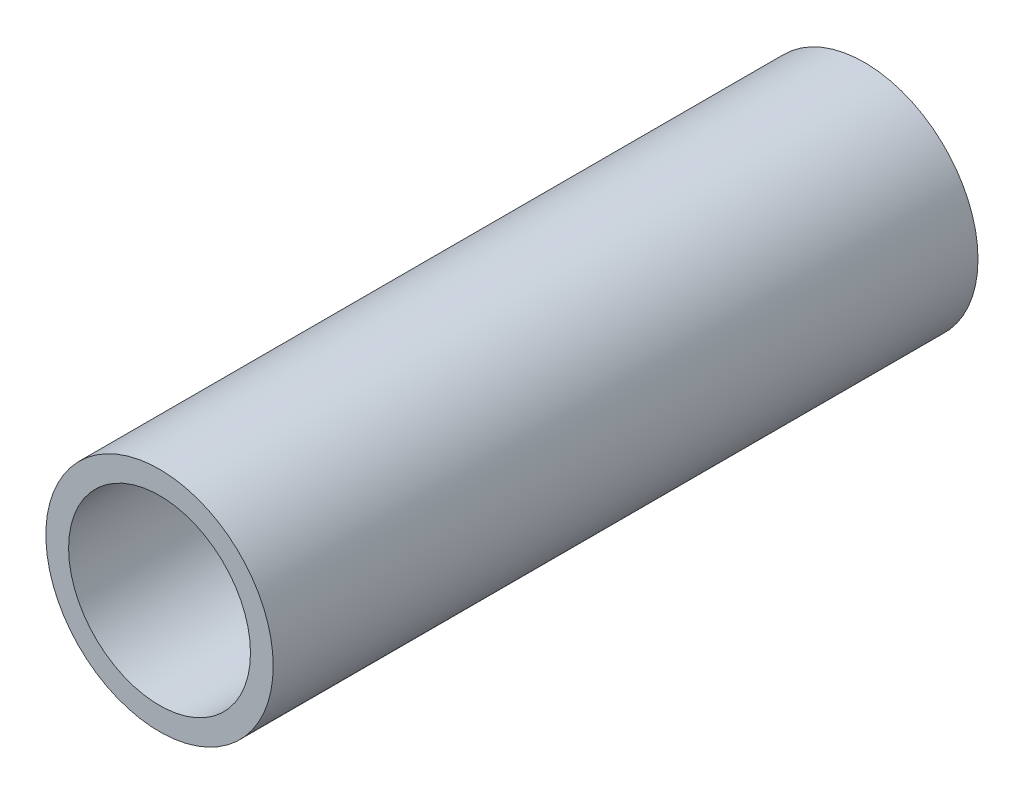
ISO-10303-21;
HEADER;
FILE_DESCRIPTION(('STEP AP214'),'2;1');
FILE_NAME('part.step','',(''),(''),'','','');
FILE_SCHEMA(('AUTOMOTIVE_DESIGN { 1 0 10303 214 1 1 1 1 }'));
ENDSEC;
DATA;
#1=APPLICATION_CONTEXT('core data for automotive mechanical design processes');
#2=APPLICATION_PROTOCOL_DEFINITION('international standard','automotive_design',2000,#1);
#3=PRODUCT_CONTEXT('',#1,'mechanical');
#4=PRODUCT('Part','Part','',(#3));
#5=PRODUCT_RELATED_PRODUCT_CATEGORY('part','',(#4));
#6=PRODUCT_DEFINITION_FORMATION('','',#4);
#7=PRODUCT_DEFINITION_CONTEXT('part definition',#1,'design');
#8=PRODUCT_DEFINITION('design','',#6,#7);
#9=PRODUCT_DEFINITION_SHAPE('','',#8);
#10=(LENGTH_UNIT() NAMED_UNIT(*) SI_UNIT(.MILLI.,.METRE.));
#11=(NAMED_UNIT(*) PLANE_ANGLE_UNIT() SI_UNIT($,.RADIAN.));
#12=(NAMED_UNIT(*) SI_UNIT($,.STERADIAN.) SOLID_ANGLE_UNIT());
#13=UNCERTAINTY_MEASURE_WITH_UNIT(LENGTH_MEASURE(1.E-05),#10,'distance_accuracy_value','');
#14=(GEOMETRIC_REPRESENTATION_CONTEXT(3) GLOBAL_UNCERTAINTY_ASSIGNED_CONTEXT((#13)) GLOBAL_UNIT_ASSIGNED_CONTEXT((#10,
#11,#12)) REPRESENTATION_CONTEXT('',''));
#15=CARTESIAN_POINT('',(0.,0.,0.));
#16=DIRECTION('',(0.,0.,1.));
#17=DIRECTION('',(1.,0.,0.));
#18=AXIS2_PLACEMENT_3D('',#15,#16,#17);
#19=CARTESIAN_POINT('',(0.,0.,31.));
#20=DIRECTION('',(0.,0.,1.));
#21=DIRECTION('',(1.,0.,0.));
#22=AXIS2_PLACEMENT_3D('',#19,#20,#21);
#23=PLANE('',#22);
#24=CARTESIAN_POINT('',(0.,0.,31.));
#25=DIRECTION('',(0.,0.,1.));
#26=DIRECTION('',(1.,0.,0.));
#27=AXIS2_PLACEMENT_3D('',#24,#25,#26);
#28=CIRCLE('',#27,5.);
#29=CARTESIAN_POINT('',(5.,0.,31.));
#30=VERTEX_POINT('',#29);
#31=EDGE_CURVE('E10',#30,#30,#28,.T.);
#32=ORIENTED_EDGE('',*,*,#31,.T.);
#33=EDGE_LOOP('',(#32));
#34=FACE_BOUND('',#33,.T.);
#35=CARTESIAN_POINT('',(0.,0.,31.));
#36=DIRECTION('',(0.,0.,1.));
#37=DIRECTION('',(1.,0.,0.));
#38=AXIS2_PLACEMENT_3D('',#35,#36,#37);
#39=CIRCLE('',#38,4.);
#40=CARTESIAN_POINT('',(4.,0.,31.));
#41=VERTEX_POINT('',#40);
#42=EDGE_CURVE('E42',#41,#41,#39,.T.);
#43=ORIENTED_EDGE('',*,*,#42,.F.);
#44=EDGE_LOOP('',(#43));
#45=FACE_BOUND('',#44,.T.);
#46=ADVANCED_FACE('F31',(#34,#45),#23,.T.);
#47=CARTESIAN_POINT('',(0.,0.,0.));
#48=DIRECTION('',(0.,0.,1.));
#49=DIRECTION('',(1.,0.,0.));
#50=AXIS2_PLACEMENT_3D('',#47,#48,#49);
#51=PLANE('',#50);
#52=CARTESIAN_POINT('',(0.,0.,0.));
#53=DIRECTION('',(0.,0.,1.));
#54=DIRECTION('',(1.,0.,0.));
#55=AXIS2_PLACEMENT_3D('',#52,#53,#54);
#56=CIRCLE('',#55,5.);
#57=CARTESIAN_POINT('',(5.,0.,0.));
#58=VERTEX_POINT('',#57);
#59=EDGE_CURVE('E35',#58,#58,#56,.T.);
#60=ORIENTED_EDGE('',*,*,#59,.F.);
#61=EDGE_LOOP('',(#60));
#62=FACE_BOUND('',#61,.T.);
#63=CARTESIAN_POINT('',(0.,0.,0.));
#64=DIRECTION('',(0.,0.,1.));
#65=DIRECTION('',(1.,0.,0.));
#66=AXIS2_PLACEMENT_3D('',#63,#64,#65);
#67=CIRCLE('',#66,4.);
#68=CARTESIAN_POINT('',(4.,0.,0.));
#69=VERTEX_POINT('',#68);
#70=EDGE_CURVE('E44',#69,#69,#67,.T.);
#71=ORIENTED_EDGE('',*,*,#70,.T.);
#72=EDGE_LOOP('',(#71));
#73=FACE_BOUND('',#72,.T.);
#74=ADVANCED_FACE('F54',(#62,#73),#51,.F.);
#75=CARTESIAN_POINT('',(0.,0.,31.));
#76=DIRECTION('',(0.,0.,-1.));
#77=DIRECTION('',(-1.,0.,0.));
#78=AXIS2_PLACEMENT_3D('',#75,#76,#77);
#79=CYLINDRICAL_SURFACE('',#78,5.);
#80=ORIENTED_EDGE('',*,*,#31,.F.);
#81=EDGE_LOOP('',(#80));
#82=FACE_BOUND('',#81,.T.);
#83=ORIENTED_EDGE('',*,*,#59,.T.);
#84=EDGE_LOOP('',(#83));
#85=FACE_BOUND('',#84,.T.);
#86=ADVANCED_FACE('F33',(#82,#85),#79,.T.);
#87=CARTESIAN_POINT('',(0.,0.,31.));
#88=DIRECTION('',(0.,0.,-1.));
#89=DIRECTION('',(-1.,0.,0.));
#90=AXIS2_PLACEMENT_3D('',#87,#88,#89);
#91=CYLINDRICAL_SURFACE('',#90,4.);
#92=ORIENTED_EDGE('',*,*,#42,.T.);
#93=EDGE_LOOP('',(#92));
#94=FACE_BOUND('',#93,.T.);
#95=ORIENTED_EDGE('',*,*,#70,.F.);
#96=EDGE_LOOP('',(#95));
#97=FACE_BOUND('',#96,.T.);
#98=ADVANCED_FACE('F50',(#94,#97),#91,.F.);
#99=CLOSED_SHELL('',(#46,#74,#86,#98));
#100=MANIFOLD_SOLID_BREP('B2',#99);
#101=ADVANCED_BREP_SHAPE_REPRESENTATION('',(#18,#100),#14);
#102=SHAPE_DEFINITION_REPRESENTATION(#9,#101);
ENDSEC;
END-ISO-10303-21;
